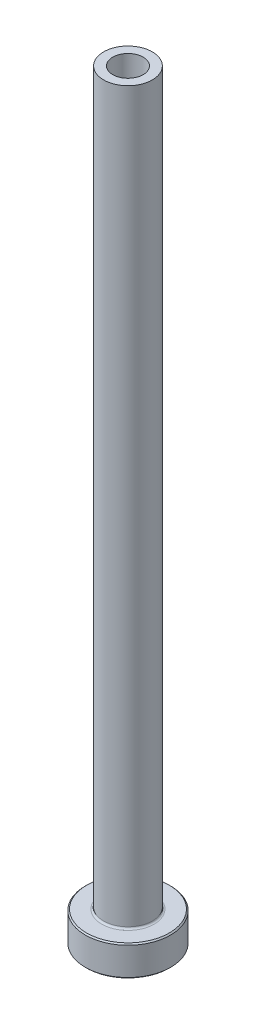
from build123d import *

# Parameters (mm, degrees)
FILLET1_R     = 0.3
CHAMFER1_SIZE = 0.2
CHAMFER3_SIZE = 0.5


with BuildPart() as part:
    # Sketch1 → Revolve1 (revolve)
    with BuildSketch(Plane.XY, mode=Mode.PRIVATE) as revolve1_sk:
        Polygon((-2.5, 125), (-4, 125), (-4, 5), (-7, 5), (-7, 0), (-2.75, 0), (-2.75, 68), (-2.5, 80), align=None)
    revolve(revolve1_sk.sketch.rotate(Axis((0, 92.187680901, 0), (0, -1, 0)), 270), axis=Axis((0, 92.187680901, 0), (0, -1, 0)))

    # Fillet1
    fillet1_edges = [part.edges().sort_by_distance(p)[0] for p in [
        (0, 5, -4),
    ]]
    fillet(fillet1_edges, radius=FILLET1_R)

    # Chamfer1
    chamfer1_edges = [part.edges().sort_by_distance(p)[0] for p in [
        (0, 0, -7),
        (0, 5, -7),
    ]]
    chamfer(chamfer1_edges, length=CHAMFER1_SIZE)

    # Chamfer3
    chamfer3_edges = [part.edges().sort_by_distance(p)[0] for p in [
        (0, 0, -2.75),
    ]]
    chamfer(chamfer3_edges, length=CHAMFER3_SIZE)


solid = part.part
